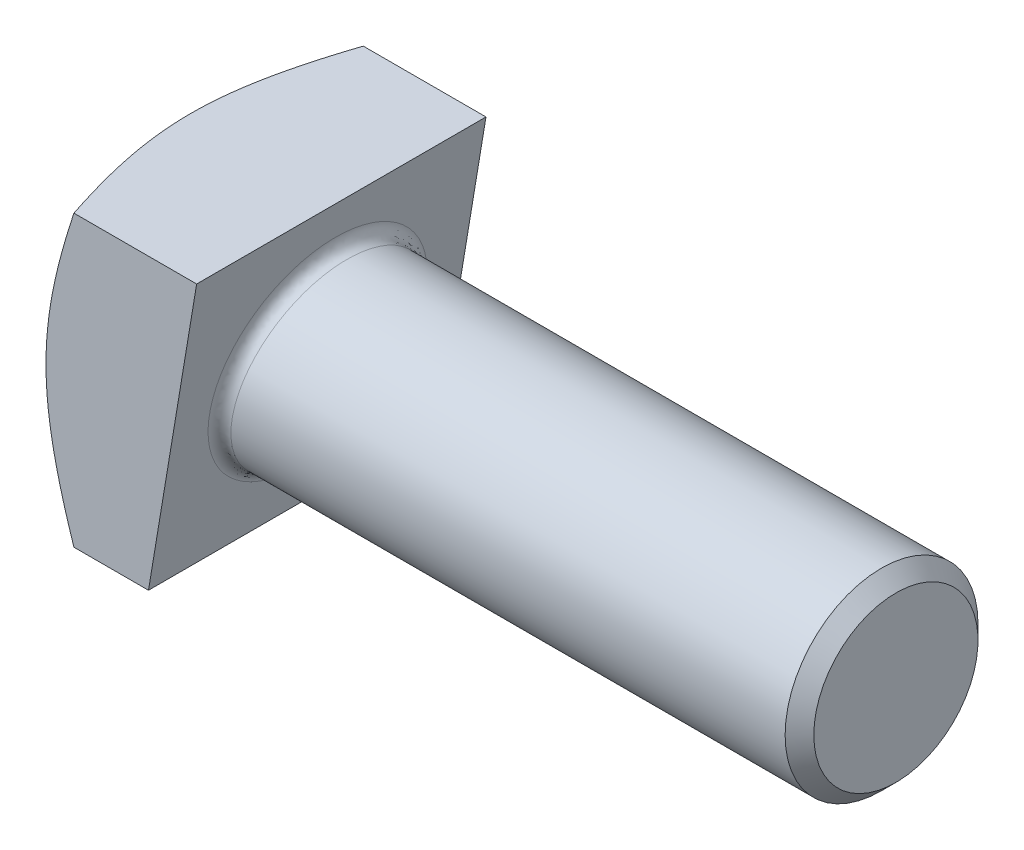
from build123d import *

# Parameters (mm, degrees)
BASEHEAD_DEPTH = 19.05
HEADFILLET_R   = 1.524


with BuildPart() as part:
    # Sketch1 → BaseHead (new, symmetric)
    with BuildSketch(Plane.XY):
        Polygon((0, -19.05), (0, 19.05), (19.8374, 19.05), (13.495821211, -19.05), align=None)
    extrude(amount=BASEHEAD_DEPTH, both=True)

    # BodySke → Body (revolve)
    with BuildSketch(Plane.XY, mode=Mode.PRIVATE) as body_sk:
        Polygon((0, 0), (0, 12.7), (90.976850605, 12.7), (92.866610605, 10.81024), (92.866610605, 0), align=None)
    revolve(body_sk.sketch.rotate(Axis((0, 0, 0), (1, 0, 0)), 90), axis=Axis((0, 0, 0), (1, 0, 0)))

    # Sketch3 → HeadChamfer (revolve, cut)
    with BuildSketch(Plane(origin=(0, 0, 0), x_dir=(1, 0, 0), z_dir=(0, -0.7071067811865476, 0.7071067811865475))):
        Polygon((0, 19.05), (9.601632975, 39.640768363), (-6.35, 39.640768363), (-6.35, 19.05), align=None)
    revolve(axis=Axis((0, 0, 0), (1, 0, 0)), mode=Mode.SUBTRACT)

    # HeadFillet
    headfillet_edges = [part.edges().sort_by_distance(p)[0] for p in [
        (16.666610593, -7.7e-08, -12.7),
    ]]
    fillet(headfillet_edges, radius=HEADFILLET_R)


solid = part.part
